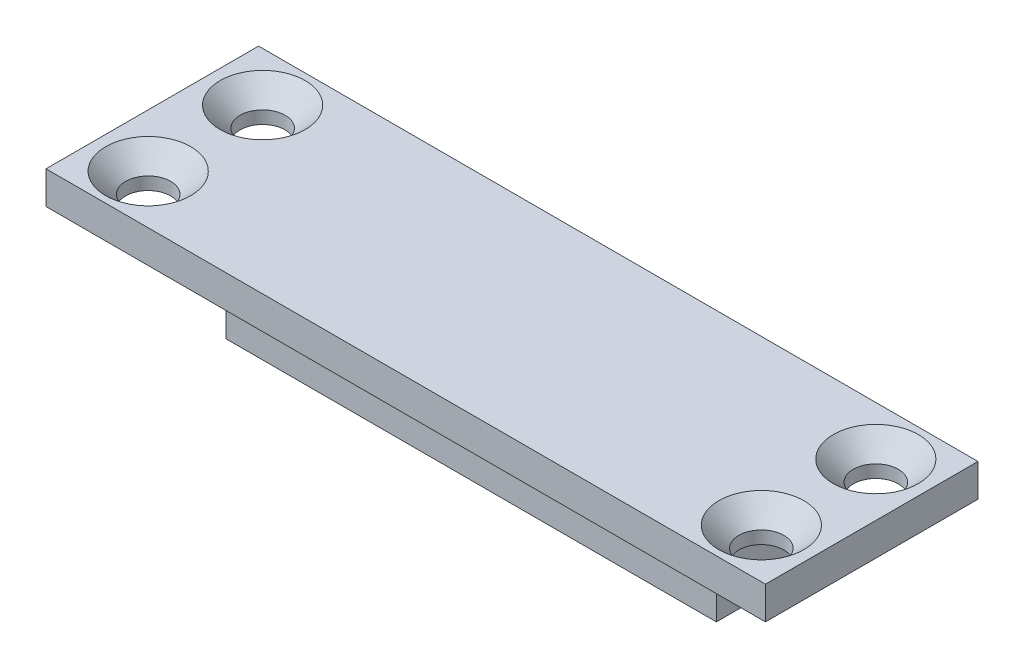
from build123d import *

# Parameters (mm, degrees)
EXTRUDE_1_DEPTH             = 88
SKETCH_2_W                  = 14
SKETCH_2_H                  = 11
CUT_EXTRUDE_1_DEPTH         = 33.5
HOLE_WIZARD_M51_D           = 5.5
HOLE_WIZARD_M51_CSINK_D     = 10.4
HOLE_WIZARD_M51_CSINK_ANGLE = 90


with BuildPart() as part:
    # Sketch 1 → Extrude 1 (new body)
    with BuildSketch(Plane(origin=(0, 0, 0), x_dir=(0, 0, -1), z_dir=(1, 0, 0))):
        Polygon((5, -4), (13, -4), (13, 0), (-13, 0), (-13, -4), (-5, -4), (-5, -15), (5, -15), align=None)
    extrude(amount=EXTRUDE_1_DEPTH)

    # Sketch 2 → Cut-Extrude 1 (cut, symmetric)
    with BuildSketch(Plane.XY):
        with Locations((7, -9.5)):
            Rectangle(SKETCH_2_W, SKETCH_2_H)
        with Locations((81, -9.5)):
            Rectangle(SKETCH_2_W, SKETCH_2_H)
    extrude(amount=CUT_EXTRUDE_1_DEPTH, both=True, mode=Mode.SUBTRACT)

    # Hole Wizard M51 (through all)
    with Locations(Plane(origin=(0, 0, 0), x_dir=(-1, 0, 0), z_dir=(0, 1, 0))):
        with Locations((-6.5, 7), (-6.5, -7), (-81.5, -7), (-81.5, 7)):
            CounterSinkHole(HOLE_WIZARD_M51_D / 2, HOLE_WIZARD_M51_CSINK_D / 2, counter_sink_angle=HOLE_WIZARD_M51_CSINK_ANGLE)


solid = part.part
